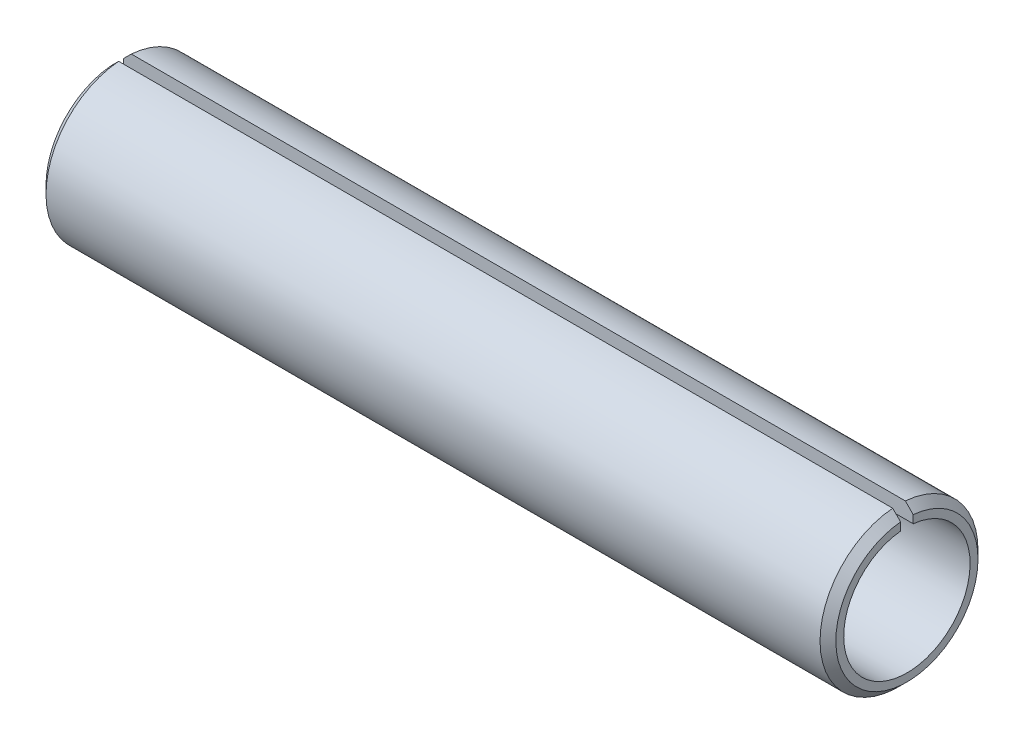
from build123d import *

# Parameters (mm, degrees)
ENL_V_MAT_EXTRU_2_DEPTH = 26.248762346


with BuildPart() as part:
    # Esquisse1 → Base-R_volution (revolve)
    with BuildSketch(Plane.XY, mode=Mode.PRIVATE) as base_r_volution_sk:
        Polygon((0, 2), (0, 2.25), (0.25, 2.5), (24.75, 2.5), (25, 2.25), (25, 2), align=None)
    revolve(base_r_volution_sk.sketch.rotate(Axis((0, 0, 0), (1, 0, 0)), 90), axis=Axis((0, 0, 0), (1, 0, 0)))

    # Esquisse2 → Enl_v. mat.-Extru.2 (cut, through all)
    with BuildSketch(Plane(origin=(0, 0, 0), x_dir=(0, 0, -1), z_dir=(1, 0, 0))):
        with BuildLine():
            Line((0.2, 2.491987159), (0.2, 1.989974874))
            ThreePointArc((0.2, 1.989974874), (0, 2), (-0.2, 1.989974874))
            Line((-0.2, 1.989974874), (-0.2, 2.491987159))
            ThreePointArc((-0.2, 2.491987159), (0, 2.5), (0.2, 2.491987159))
        make_face()
    extrude(amount=ENL_V_MAT_EXTRU_2_DEPTH, mode=Mode.SUBTRACT)


solid = part.part
